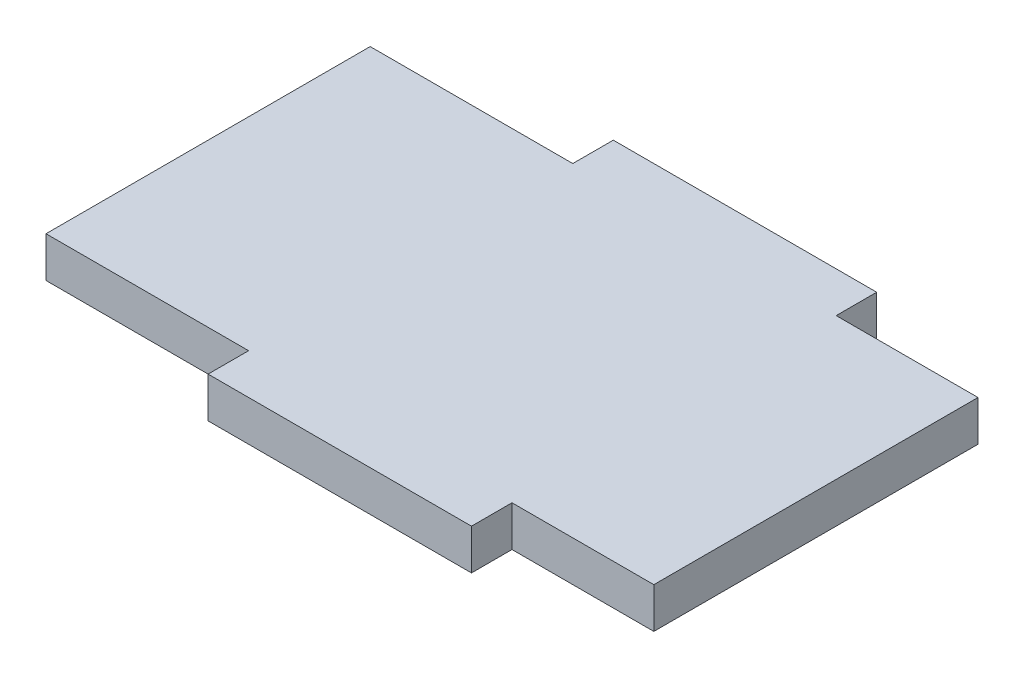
ISO-10303-21;
HEADER;
FILE_DESCRIPTION(('STEP AP214'),'2;1');
FILE_NAME('part.step','',(''),(''),'','','');
FILE_SCHEMA(('AUTOMOTIVE_DESIGN { 1 0 10303 214 1 1 1 1 }'));
ENDSEC;
DATA;
#1=APPLICATION_CONTEXT('core data for automotive mechanical design processes');
#2=APPLICATION_PROTOCOL_DEFINITION('international standard','automotive_design',2000,#1);
#3=PRODUCT_CONTEXT('',#1,'mechanical');
#4=PRODUCT('Part','Part','',(#3));
#5=PRODUCT_RELATED_PRODUCT_CATEGORY('part','',(#4));
#6=PRODUCT_DEFINITION_FORMATION('','',#4);
#7=PRODUCT_DEFINITION_CONTEXT('part definition',#1,'design');
#8=PRODUCT_DEFINITION('design','',#6,#7);
#9=PRODUCT_DEFINITION_SHAPE('','',#8);
#10=(LENGTH_UNIT() NAMED_UNIT(*) SI_UNIT(.MILLI.,.METRE.));
#11=(NAMED_UNIT(*) PLANE_ANGLE_UNIT() SI_UNIT($,.RADIAN.));
#12=(NAMED_UNIT(*) SI_UNIT($,.STERADIAN.) SOLID_ANGLE_UNIT());
#13=UNCERTAINTY_MEASURE_WITH_UNIT(LENGTH_MEASURE(1.E-05),#10,'distance_accuracy_value','');
#14=(GEOMETRIC_REPRESENTATION_CONTEXT(3) GLOBAL_UNCERTAINTY_ASSIGNED_CONTEXT((#13)) GLOBAL_UNIT_ASSIGNED_CONTEXT((#10,
#11,#12)) REPRESENTATION_CONTEXT('',''));
#15=CARTESIAN_POINT('',(0.,0.,0.));
#16=DIRECTION('',(0.,0.,1.));
#17=DIRECTION('',(1.,0.,0.));
#18=AXIS2_PLACEMENT_3D('',#15,#16,#17);
#19=CARTESIAN_POINT('',(30.0000000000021,-25.7299764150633,16.));
#20=DIRECTION('',(0.,0.,-1.));
#21=DIRECTION('',(1.,0.,0.));
#22=AXIS2_PLACEMENT_3D('',#19,#20,#21);
#23=PLANE('',#22);
#24=DIRECTION('',(0.,-1.,0.));
#25=VECTOR('',#24,1.);
#26=CARTESIAN_POINT('',(-13.4999999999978,-21.2500000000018,16.));
#27=LINE('',#26,#25);
#28=CARTESIAN_POINT('',(-13.4999999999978,-21.2500000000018,16.));
#29=VERTEX_POINT('',#28);
#30=CARTESIAN_POINT('',(-13.4999999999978,-23.2500000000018,16.));
#31=VERTEX_POINT('',#30);
#32=EDGE_CURVE('E143',#29,#31,#27,.T.);
#33=ORIENTED_EDGE('',*,*,#32,.F.);
#34=DIRECTION('',(1.,0.,0.));
#35=VECTOR('',#34,1.);
#36=CARTESIAN_POINT('',(6.50000000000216,-21.2500000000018,16.));
#37=LINE('',#36,#35);
#38=CARTESIAN_POINT('',(-23.4999999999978,-21.2500000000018,16.));
#39=VERTEX_POINT('',#38);
#40=EDGE_CURVE('E42',#39,#29,#37,.T.);
#41=ORIENTED_EDGE('',*,*,#40,.F.);
#42=DIRECTION('',(0.,1.,0.));
#43=VECTOR('',#42,1.);
#44=CARTESIAN_POINT('',(-23.4999999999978,-23.2500000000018,16.));
#45=LINE('',#44,#43);
#46=CARTESIAN_POINT('',(-23.4999999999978,-23.2500000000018,16.));
#47=VERTEX_POINT('',#46);
#48=EDGE_CURVE('E180',#47,#39,#45,.T.);
#49=ORIENTED_EDGE('',*,*,#48,.F.);
#50=DIRECTION('',(-1.,0.,0.));
#51=VECTOR('',#50,1.);
#52=CARTESIAN_POINT('',(6.50000000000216,-23.2500000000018,16.));
#53=LINE('',#52,#51);
#54=EDGE_CURVE('E50',#31,#47,#53,.T.);
#55=ORIENTED_EDGE('',*,*,#54,.F.);
#56=EDGE_LOOP('',(#33,#41,#49,#55));
#57=FACE_BOUND('',#56,.T.);
#58=ADVANCED_FACE('F33',(#57),#23,.F.);
#59=DIRECTION('',(0.,1.,0.));
#60=VECTOR('',#59,1.);
#61=CARTESIAN_POINT('',(-0.49999999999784,-23.2500000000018,16.));
#62=LINE('',#61,#60);
#63=CARTESIAN_POINT('',(-0.49999999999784,-23.2500000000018,16.));
#64=VERTEX_POINT('',#63);
#65=CARTESIAN_POINT('',(-0.49999999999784,-21.2500000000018,16.));
#66=VERTEX_POINT('',#65);
#67=EDGE_CURVE('E58',#64,#66,#62,.T.);
#68=ORIENTED_EDGE('',*,*,#67,.F.);
#69=CARTESIAN_POINT('',(6.50000000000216,-23.2500000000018,16.));
#70=VERTEX_POINT('',#69);
#71=EDGE_CURVE('E37',#70,#64,#53,.T.);
#72=ORIENTED_EDGE('',*,*,#71,.F.);
#73=DIRECTION('',(0.,-1.,0.));
#74=VECTOR('',#73,1.);
#75=CARTESIAN_POINT('',(6.50000000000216,-23.2500000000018,16.));
#76=LINE('',#75,#74);
#77=CARTESIAN_POINT('',(6.50000000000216,-21.2500000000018,16.));
#78=VERTEX_POINT('',#77);
#79=EDGE_CURVE('E11',#78,#70,#76,.T.);
#80=ORIENTED_EDGE('',*,*,#79,.F.);
#81=EDGE_CURVE('E183',#66,#78,#37,.T.);
#82=ORIENTED_EDGE('',*,*,#81,.F.);
#83=EDGE_LOOP('',(#68,#72,#80,#82));
#84=FACE_BOUND('',#83,.T.);
#85=ADVANCED_FACE('F246',(#84),#23,.F.);
#86=CARTESIAN_POINT('',(0.,0.,0.));
#87=DIRECTION('',(0.,0.,1.));
#88=DIRECTION('',(1.,0.,0.));
#89=AXIS2_PLACEMENT_3D('',#86,#87,#88);
#90=PLANE('',#89);
#91=DIRECTION('',(0.,1.,0.));
#92=VECTOR('',#91,1.);
#93=CARTESIAN_POINT('',(-13.4999999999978,-23.2500000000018,0.));
#94=LINE('',#93,#92);
#95=CARTESIAN_POINT('',(-13.4999999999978,-23.2500000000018,0.));
#96=VERTEX_POINT('',#95);
#97=CARTESIAN_POINT('',(-13.4999999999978,-21.2500000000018,0.));
#98=VERTEX_POINT('',#97);
#99=EDGE_CURVE('E147',#96,#98,#94,.T.);
#100=ORIENTED_EDGE('',*,*,#99,.F.);
#101=DIRECTION('',(1.,0.,0.));
#102=VECTOR('',#101,1.);
#103=CARTESIAN_POINT('',(6.50000000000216,-23.2500000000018,0.));
#104=LINE('',#103,#102);
#105=CARTESIAN_POINT('',(-23.4999999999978,-23.2500000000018,0.));
#106=VERTEX_POINT('',#105);
#107=EDGE_CURVE('E196',#106,#96,#104,.T.);
#108=ORIENTED_EDGE('',*,*,#107,.F.);
#109=DIRECTION('',(0.,-1.,0.));
#110=VECTOR('',#109,1.);
#111=CARTESIAN_POINT('',(-23.4999999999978,-23.2500000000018,0.));
#112=LINE('',#111,#110);
#113=CARTESIAN_POINT('',(-23.4999999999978,-21.2500000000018,0.));
#114=VERTEX_POINT('',#113);
#115=EDGE_CURVE('E192',#114,#106,#112,.T.);
#116=ORIENTED_EDGE('',*,*,#115,.F.);
#117=DIRECTION('',(-1.,0.,0.));
#118=VECTOR('',#117,1.);
#119=CARTESIAN_POINT('',(6.50000000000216,-21.2500000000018,0.));
#120=LINE('',#119,#118);
#121=EDGE_CURVE('E188',#98,#114,#120,.T.);
#122=ORIENTED_EDGE('',*,*,#121,.F.);
#123=EDGE_LOOP('',(#100,#108,#116,#122));
#124=FACE_BOUND('',#123,.T.);
#125=ADVANCED_FACE('F218',(#124),#90,.F.);
#126=DIRECTION('',(0.,-1.,0.));
#127=VECTOR('',#126,1.);
#128=CARTESIAN_POINT('',(-0.49999999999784,-23.2500000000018,0.));
#129=LINE('',#128,#127);
#130=CARTESIAN_POINT('',(-0.49999999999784,-21.2500000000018,0.));
#131=VERTEX_POINT('',#130);
#132=CARTESIAN_POINT('',(-0.49999999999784,-23.2500000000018,0.));
#133=VERTEX_POINT('',#132);
#134=EDGE_CURVE('E150',#131,#133,#129,.T.);
#135=ORIENTED_EDGE('',*,*,#134,.F.);
#136=CARTESIAN_POINT('',(6.50000000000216,-21.2500000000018,0.));
#137=VERTEX_POINT('',#136);
#138=EDGE_CURVE('E189',#137,#131,#120,.T.);
#139=ORIENTED_EDGE('',*,*,#138,.F.);
#140=DIRECTION('',(0.,1.,0.));
#141=VECTOR('',#140,1.);
#142=CARTESIAN_POINT('',(6.50000000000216,-23.2500000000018,0.));
#143=LINE('',#142,#141);
#144=CARTESIAN_POINT('',(6.50000000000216,-23.2500000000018,0.));
#145=VERTEX_POINT('',#144);
#146=EDGE_CURVE('E179',#145,#137,#143,.T.);
#147=ORIENTED_EDGE('',*,*,#146,.F.);
#148=EDGE_CURVE('E195',#133,#145,#104,.T.);
#149=ORIENTED_EDGE('',*,*,#148,.F.);
#150=EDGE_LOOP('',(#135,#139,#147,#149));
#151=FACE_BOUND('',#150,.T.);
#152=ADVANCED_FACE('F233',(#151),#90,.F.);
#153=CARTESIAN_POINT('',(6.50000000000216,-23.2500000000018,46.0665927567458));
#154=DIRECTION('',(0.,1.,0.));
#155=DIRECTION('',(0.,0.,1.));
#156=AXIS2_PLACEMENT_3D('',#153,#154,#155);
#157=PLANE('',#156);
#158=DIRECTION('',(0.,0.,-1.));
#159=VECTOR('',#158,1.);
#160=CARTESIAN_POINT('',(6.50000000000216,-23.2500000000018,46.0665927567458));
#161=LINE('',#160,#159);
#162=EDGE_CURVE('E199',#70,#145,#161,.T.);
#163=ORIENTED_EDGE('',*,*,#162,.F.);
#164=ORIENTED_EDGE('',*,*,#71,.T.);
#165=DIRECTION('',(0.,0.,-1.));
#166=VECTOR('',#165,1.);
#167=CARTESIAN_POINT('',(-0.49999999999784,-23.2500000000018,18.));
#168=LINE('',#167,#166);
#169=CARTESIAN_POINT('',(-0.49999999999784,-23.2500000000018,18.));
#170=VERTEX_POINT('',#169);
#171=EDGE_CURVE('E128',#170,#64,#168,.T.);
#172=ORIENTED_EDGE('',*,*,#171,.F.);
#173=DIRECTION('',(1.,0.,0.));
#174=VECTOR('',#173,1.);
#175=CARTESIAN_POINT('',(-13.4999999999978,-23.2500000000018,18.));
#176=LINE('',#175,#174);
#177=CARTESIAN_POINT('',(-13.4999999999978,-23.2500000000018,18.));
#178=VERTEX_POINT('',#177);
#179=EDGE_CURVE('E134',#178,#170,#176,.T.);
#180=ORIENTED_EDGE('',*,*,#179,.F.);
#181=DIRECTION('',(0.,0.,-1.));
#182=VECTOR('',#181,1.);
#183=CARTESIAN_POINT('',(-13.4999999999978,-23.2500000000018,18.));
#184=LINE('',#183,#182);
#185=EDGE_CURVE('E211',#178,#31,#184,.T.);
#186=ORIENTED_EDGE('',*,*,#185,.T.);
#187=ORIENTED_EDGE('',*,*,#54,.T.);
#188=DIRECTION('',(0.,0.,-1.));
#189=VECTOR('',#188,1.);
#190=CARTESIAN_POINT('',(-23.4999999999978,-23.2500000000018,46.0665927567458));
#191=LINE('',#190,#189);
#192=EDGE_CURVE('E202',#47,#106,#191,.T.);
#193=ORIENTED_EDGE('',*,*,#192,.T.);
#194=ORIENTED_EDGE('',*,*,#107,.T.);
#195=DIRECTION('',(0.,0.,1.));
#196=VECTOR('',#195,1.);
#197=CARTESIAN_POINT('',(-13.4999999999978,-23.2500000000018,-2.));
#198=LINE('',#197,#196);
#199=CARTESIAN_POINT('',(-13.4999999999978,-23.2500000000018,-2.));
#200=VERTEX_POINT('',#199);
#201=EDGE_CURVE('E164',#200,#96,#198,.T.);
#202=ORIENTED_EDGE('',*,*,#201,.F.);
#203=DIRECTION('',(-1.,0.,0.));
#204=VECTOR('',#203,1.);
#205=CARTESIAN_POINT('',(-13.4999999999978,-23.2500000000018,-2.));
#206=LINE('',#205,#204);
#207=CARTESIAN_POINT('',(-0.49999999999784,-23.2500000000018,-2.));
#208=VERTEX_POINT('',#207);
#209=EDGE_CURVE('E163',#208,#200,#206,.T.);
#210=ORIENTED_EDGE('',*,*,#209,.F.);
#211=DIRECTION('',(0.,0.,1.));
#212=VECTOR('',#211,1.);
#213=CARTESIAN_POINT('',(-0.49999999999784,-23.2500000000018,-2.));
#214=LINE('',#213,#212);
#215=EDGE_CURVE('E170',#208,#133,#214,.T.);
#216=ORIENTED_EDGE('',*,*,#215,.T.);
#217=ORIENTED_EDGE('',*,*,#148,.T.);
#218=EDGE_LOOP('',(#163,#164,#172,#180,#186,#187,#193,#194,#202,#210,#216,#217));
#219=FACE_BOUND('',#218,.T.);
#220=ADVANCED_FACE('F146',(#219),#157,.F.);
#221=CARTESIAN_POINT('',(-23.4999999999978,-23.2500000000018,46.0665927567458));
#222=DIRECTION('',(1.,0.,0.));
#223=DIRECTION('',(0.,0.,-1.));
#224=AXIS2_PLACEMENT_3D('',#221,#222,#223);
#225=PLANE('',#224);
#226=ORIENTED_EDGE('',*,*,#192,.F.);
#227=ORIENTED_EDGE('',*,*,#48,.T.);
#228=DIRECTION('',(0.,0.,-1.));
#229=VECTOR('',#228,1.);
#230=CARTESIAN_POINT('',(-23.4999999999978,-21.2500000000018,46.0665927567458));
#231=LINE('',#230,#229);
#232=EDGE_CURVE('E204',#39,#114,#231,.T.);
#233=ORIENTED_EDGE('',*,*,#232,.T.);
#234=ORIENTED_EDGE('',*,*,#115,.T.);
#235=EDGE_LOOP('',(#226,#227,#233,#234));
#236=FACE_BOUND('',#235,.T.);
#237=ADVANCED_FACE('F214',(#236),#225,.F.);
#238=CARTESIAN_POINT('',(6.50000000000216,-21.2500000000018,46.0665927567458));
#239=DIRECTION('',(0.,-1.,0.));
#240=DIRECTION('',(1.,0.,0.));
#241=AXIS2_PLACEMENT_3D('',#238,#239,#240);
#242=PLANE('',#241);
#243=ORIENTED_EDGE('',*,*,#232,.F.);
#244=ORIENTED_EDGE('',*,*,#40,.T.);
#245=DIRECTION('',(0.,0.,-1.));
#246=VECTOR('',#245,1.);
#247=CARTESIAN_POINT('',(-13.4999999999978,-21.2500000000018,18.));
#248=LINE('',#247,#246);
#249=CARTESIAN_POINT('',(-13.4999999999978,-21.2500000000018,18.));
#250=VERTEX_POINT('',#249);
#251=EDGE_CURVE('E152',#250,#29,#248,.T.);
#252=ORIENTED_EDGE('',*,*,#251,.F.);
#253=DIRECTION('',(-1.,0.,0.));
#254=VECTOR('',#253,1.);
#255=CARTESIAN_POINT('',(-0.49999999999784,-21.2500000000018,18.));
#256=LINE('',#255,#254);
#257=CARTESIAN_POINT('',(-0.49999999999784,-21.2500000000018,18.));
#258=VERTEX_POINT('',#257);
#259=EDGE_CURVE('E133',#258,#250,#256,.T.);
#260=ORIENTED_EDGE('',*,*,#259,.F.);
#261=DIRECTION('',(0.,0.,-1.));
#262=VECTOR('',#261,1.);
#263=CARTESIAN_POINT('',(-0.49999999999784,-21.2500000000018,18.));
#264=LINE('',#263,#262);
#265=EDGE_CURVE('E130',#258,#66,#264,.T.);
#266=ORIENTED_EDGE('',*,*,#265,.T.);
#267=ORIENTED_EDGE('',*,*,#81,.T.);
#268=DIRECTION('',(0.,0.,-1.));
#269=VECTOR('',#268,1.);
#270=CARTESIAN_POINT('',(6.50000000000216,-21.2500000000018,46.0665927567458));
#271=LINE('',#270,#269);
#272=EDGE_CURVE('E206',#78,#137,#271,.T.);
#273=ORIENTED_EDGE('',*,*,#272,.T.);
#274=ORIENTED_EDGE('',*,*,#138,.T.);
#275=DIRECTION('',(0.,0.,1.));
#276=VECTOR('',#275,1.);
#277=CARTESIAN_POINT('',(-0.49999999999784,-21.2500000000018,-2.));
#278=LINE('',#277,#276);
#279=CARTESIAN_POINT('',(-0.49999999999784,-21.2500000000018,-2.));
#280=VERTEX_POINT('',#279);
#281=EDGE_CURVE('E173',#280,#131,#278,.T.);
#282=ORIENTED_EDGE('',*,*,#281,.F.);
#283=DIRECTION('',(1.,0.,0.));
#284=VECTOR('',#283,1.);
#285=CARTESIAN_POINT('',(-13.4999999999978,-21.2500000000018,-2.));
#286=LINE('',#285,#284);
#287=CARTESIAN_POINT('',(-13.4999999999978,-21.2500000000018,-2.));
#288=VERTEX_POINT('',#287);
#289=EDGE_CURVE('E159',#288,#280,#286,.T.);
#290=ORIENTED_EDGE('',*,*,#289,.F.);
#291=DIRECTION('',(0.,0.,1.));
#292=VECTOR('',#291,1.);
#293=CARTESIAN_POINT('',(-13.4999999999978,-21.2500000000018,-2.));
#294=LINE('',#293,#292);
#295=EDGE_CURVE('E176',#288,#98,#294,.T.);
#296=ORIENTED_EDGE('',*,*,#295,.T.);
#297=ORIENTED_EDGE('',*,*,#121,.T.);
#298=EDGE_LOOP('',(#243,#244,#252,#260,#266,#267,#273,#274,#282,#290,#296,#297));
#299=FACE_BOUND('',#298,.T.);
#300=ADVANCED_FACE('F235',(#299),#242,.F.);
#301=CARTESIAN_POINT('',(6.50000000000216,-23.2500000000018,46.0665927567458));
#302=DIRECTION('',(-1.,0.,0.));
#303=DIRECTION('',(0.,-1.,0.));
#304=AXIS2_PLACEMENT_3D('',#301,#302,#303);
#305=PLANE('',#304);
#306=ORIENTED_EDGE('',*,*,#272,.F.);
#307=ORIENTED_EDGE('',*,*,#79,.T.);
#308=ORIENTED_EDGE('',*,*,#162,.T.);
#309=ORIENTED_EDGE('',*,*,#146,.T.);
#310=EDGE_LOOP('',(#306,#307,#308,#309));
#311=FACE_BOUND('',#310,.T.);
#312=ADVANCED_FACE('F35',(#311),#305,.F.);
#313=CARTESIAN_POINT('',(-13.4999999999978,-23.2500000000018,-2.));
#314=DIRECTION('',(1.,0.,0.));
#315=DIRECTION('',(0.,1.,0.));
#316=AXIS2_PLACEMENT_3D('',#313,#314,#315);
#317=PLANE('',#316);
#318=ORIENTED_EDGE('',*,*,#99,.T.);
#319=ORIENTED_EDGE('',*,*,#295,.F.);
#320=DIRECTION('',(0.,1.,0.));
#321=VECTOR('',#320,1.);
#322=CARTESIAN_POINT('',(-13.4999999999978,-23.2500000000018,-2.));
#323=LINE('',#322,#321);
#324=EDGE_CURVE('E156',#200,#288,#323,.T.);
#325=ORIENTED_EDGE('',*,*,#324,.F.);
#326=ORIENTED_EDGE('',*,*,#201,.T.);
#327=EDGE_LOOP('',(#318,#319,#325,#326));
#328=FACE_BOUND('',#327,.T.);
#329=ADVANCED_FACE('F223',(#328),#317,.F.);
#330=CARTESIAN_POINT('',(-0.49999999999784,-23.2500000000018,-2.));
#331=DIRECTION('',(-1.,0.,0.));
#332=DIRECTION('',(0.,0.,1.));
#333=AXIS2_PLACEMENT_3D('',#330,#331,#332);
#334=PLANE('',#333);
#335=ORIENTED_EDGE('',*,*,#134,.T.);
#336=ORIENTED_EDGE('',*,*,#215,.F.);
#337=DIRECTION('',(0.,-1.,0.));
#338=VECTOR('',#337,1.);
#339=CARTESIAN_POINT('',(-0.49999999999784,-23.2500000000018,-2.));
#340=LINE('',#339,#338);
#341=EDGE_CURVE('E161',#280,#208,#340,.T.);
#342=ORIENTED_EDGE('',*,*,#341,.F.);
#343=ORIENTED_EDGE('',*,*,#281,.T.);
#344=EDGE_LOOP('',(#335,#336,#342,#343));
#345=FACE_BOUND('',#344,.T.);
#346=ADVANCED_FACE('F231',(#345),#334,.F.);
#347=CARTESIAN_POINT('',(0.,0.,-2.));
#348=DIRECTION('',(0.,0.,-1.));
#349=DIRECTION('',(-1.,0.,0.));
#350=AXIS2_PLACEMENT_3D('',#347,#348,#349);
#351=PLANE('',#350);
#352=ORIENTED_EDGE('',*,*,#324,.T.);
#353=ORIENTED_EDGE('',*,*,#289,.T.);
#354=ORIENTED_EDGE('',*,*,#341,.T.);
#355=ORIENTED_EDGE('',*,*,#209,.T.);
#356=EDGE_LOOP('',(#352,#353,#354,#355));
#357=FACE_BOUND('',#356,.T.);
#358=ADVANCED_FACE('F226',(#357),#351,.T.);
#359=CARTESIAN_POINT('',(-0.49999999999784,-23.2500000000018,18.));
#360=DIRECTION('',(-1.,0.,0.));
#361=DIRECTION('',(0.,0.,1.));
#362=AXIS2_PLACEMENT_3D('',#359,#360,#361);
#363=PLANE('',#362);
#364=ORIENTED_EDGE('',*,*,#67,.T.);
#365=ORIENTED_EDGE('',*,*,#265,.F.);
#366=DIRECTION('',(0.,1.,0.));
#367=VECTOR('',#366,1.);
#368=CARTESIAN_POINT('',(-0.49999999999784,-23.2500000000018,18.));
#369=LINE('',#368,#367);
#370=EDGE_CURVE('E124',#170,#258,#369,.T.);
#371=ORIENTED_EDGE('',*,*,#370,.F.);
#372=ORIENTED_EDGE('',*,*,#171,.T.);
#373=EDGE_LOOP('',(#364,#365,#371,#372));
#374=FACE_BOUND('',#373,.T.);
#375=ADVANCED_FACE('F126',(#374),#363,.F.);
#376=CARTESIAN_POINT('',(-13.4999999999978,-21.2500000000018,18.));
#377=DIRECTION('',(1.,0.,0.));
#378=DIRECTION('',(0.,1.,0.));
#379=AXIS2_PLACEMENT_3D('',#376,#377,#378);
#380=PLANE('',#379);
#381=ORIENTED_EDGE('',*,*,#32,.T.);
#382=ORIENTED_EDGE('',*,*,#185,.F.);
#383=DIRECTION('',(0.,-1.,0.));
#384=VECTOR('',#383,1.);
#385=CARTESIAN_POINT('',(-13.4999999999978,-21.2500000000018,18.));
#386=LINE('',#385,#384);
#387=EDGE_CURVE('E139',#250,#178,#386,.T.);
#388=ORIENTED_EDGE('',*,*,#387,.F.);
#389=ORIENTED_EDGE('',*,*,#251,.T.);
#390=EDGE_LOOP('',(#381,#382,#388,#389));
#391=FACE_BOUND('',#390,.T.);
#392=ADVANCED_FACE('F239',(#391),#380,.F.);
#393=CARTESIAN_POINT('',(0.,0.,18.));
#394=DIRECTION('',(0.,0.,1.));
#395=DIRECTION('',(1.,0.,0.));
#396=AXIS2_PLACEMENT_3D('',#393,#394,#395);
#397=PLANE('',#396);
#398=ORIENTED_EDGE('',*,*,#179,.T.);
#399=ORIENTED_EDGE('',*,*,#370,.T.);
#400=ORIENTED_EDGE('',*,*,#259,.T.);
#401=ORIENTED_EDGE('',*,*,#387,.T.);
#402=EDGE_LOOP('',(#398,#399,#400,#401));
#403=FACE_BOUND('',#402,.T.);
#404=ADVANCED_FACE('F137',(#403),#397,.T.);
#405=CLOSED_SHELL('',(#58,#85,#125,#152,#220,#237,#300,#312,#329,#346,#358,#375,#392,#404));
#406=MANIFOLD_SOLID_BREP('B2',#405);
#407=ADVANCED_BREP_SHAPE_REPRESENTATION('',(#18,#406),#14);
#408=SHAPE_DEFINITION_REPRESENTATION(#9,#407);
ENDSEC;
END-ISO-10303-21;
